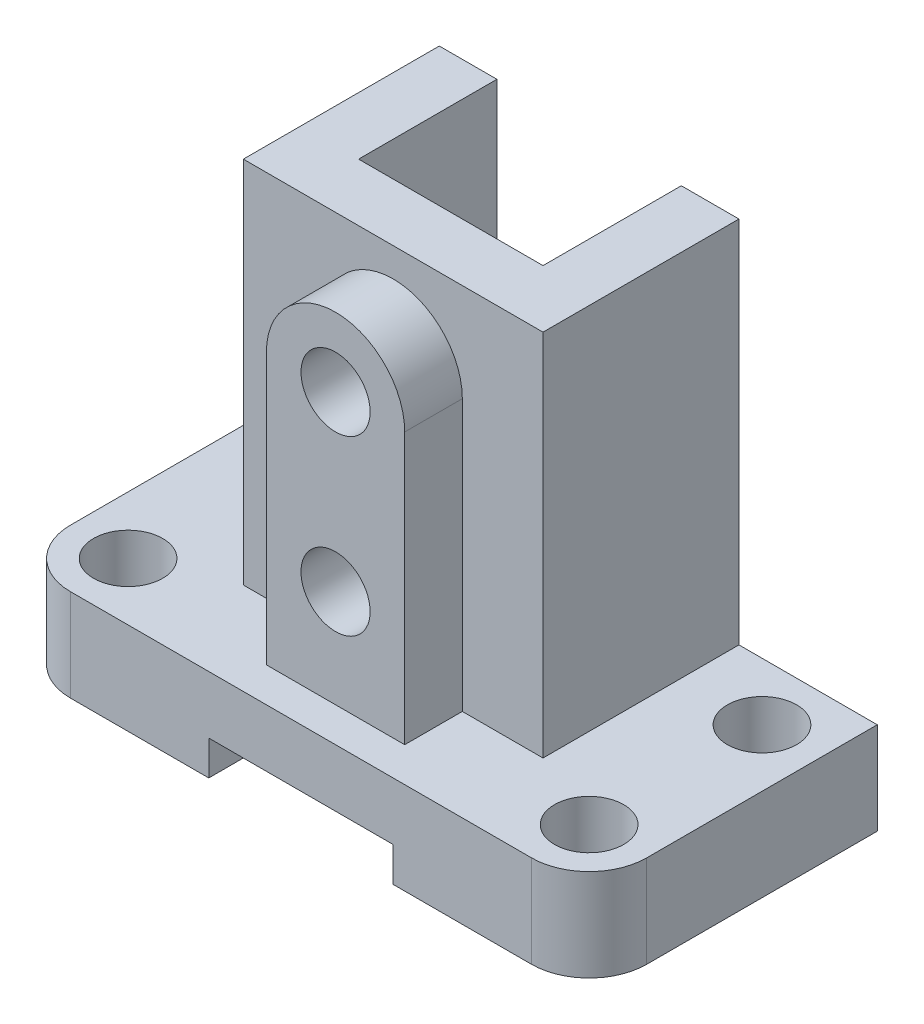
ISO-10303-21;
HEADER;
FILE_DESCRIPTION(('STEP AP214'),'2;1');
FILE_NAME('part.step','',(''),(''),'','','');
FILE_SCHEMA(('AUTOMOTIVE_DESIGN { 1 0 10303 214 1 1 1 1 }'));
ENDSEC;
DATA;
#1=APPLICATION_CONTEXT('core data for automotive mechanical design processes');
#2=APPLICATION_PROTOCOL_DEFINITION('international standard','automotive_design',2000,#1);
#3=PRODUCT_CONTEXT('',#1,'mechanical');
#4=PRODUCT('Part','Part','',(#3));
#5=PRODUCT_RELATED_PRODUCT_CATEGORY('part','',(#4));
#6=PRODUCT_DEFINITION_FORMATION('','',#4);
#7=PRODUCT_DEFINITION_CONTEXT('part definition',#1,'design');
#8=PRODUCT_DEFINITION('design','',#6,#7);
#9=PRODUCT_DEFINITION_SHAPE('','',#8);
#10=(LENGTH_UNIT() NAMED_UNIT(*) SI_UNIT(.MILLI.,.METRE.));
#11=(NAMED_UNIT(*) PLANE_ANGLE_UNIT() SI_UNIT($,.RADIAN.));
#12=(NAMED_UNIT(*) SI_UNIT($,.STERADIAN.) SOLID_ANGLE_UNIT());
#13=UNCERTAINTY_MEASURE_WITH_UNIT(LENGTH_MEASURE(1.E-05),#10,'distance_accuracy_value','');
#14=(GEOMETRIC_REPRESENTATION_CONTEXT(3) GLOBAL_UNCERTAINTY_ASSIGNED_CONTEXT((#13)) GLOBAL_UNIT_ASSIGNED_CONTEXT((#10,
#11,#12)) REPRESENTATION_CONTEXT('',''));
#15=CARTESIAN_POINT('',(0.,0.,0.));
#16=DIRECTION('',(0.,0.,1.));
#17=DIRECTION('',(1.,0.,0.));
#18=AXIS2_PLACEMENT_3D('',#15,#16,#17);
#19=CARTESIAN_POINT('',(-80.,0.,34.5129568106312));
#20=DIRECTION('',(0.,-1.,0.));
#21=DIRECTION('',(0.,0.,-1.));
#22=AXIS2_PLACEMENT_3D('',#19,#20,#21);
#23=PLANE('',#22);
#24=DIRECTION('',(0.,0.,1.));
#25=VECTOR('',#24,1.);
#26=CARTESIAN_POINT('',(-32.,0.,-45.4870431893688));
#27=LINE('',#26,#25);
#28=CARTESIAN_POINT('',(-32.,0.,-45.4870431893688));
#29=VERTEX_POINT('',#28);
#30=CARTESIAN_POINT('',(-32.,0.,54.5129568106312));
#31=VERTEX_POINT('',#30);
#32=EDGE_CURVE('E238',#29,#31,#27,.T.);
#33=ORIENTED_EDGE('',*,*,#32,.T.);
#34=DIRECTION('',(1.,0.,0.));
#35=VECTOR('',#34,1.);
#36=CARTESIAN_POINT('',(-79.9999999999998,0.,54.5129568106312));
#37=LINE('',#36,#35);
#38=CARTESIAN_POINT('',(-79.9999999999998,0.,54.5129568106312));
#39=VERTEX_POINT('',#38);
#40=EDGE_CURVE('E318',#39,#31,#37,.T.);
#41=ORIENTED_EDGE('',*,*,#40,.F.);
#42=CARTESIAN_POINT('',(-80.,0.,34.5129568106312));
#43=DIRECTION('',(0.,1.,0.));
#44=DIRECTION('',(0.,0.,-1.));
#45=AXIS2_PLACEMENT_3D('',#42,#43,#44);
#46=CIRCLE('',#45,20.);
#47=CARTESIAN_POINT('',(-100.,0.,34.5129568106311));
#48=VERTEX_POINT('',#47);
#49=EDGE_CURVE('E314',#48,#39,#46,.T.);
#50=ORIENTED_EDGE('',*,*,#49,.F.);
#51=DIRECTION('',(0.,0.,1.));
#52=VECTOR('',#51,1.);
#53=CARTESIAN_POINT('',(-100.,0.,-45.4870431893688));
#54=LINE('',#53,#52);
#55=CARTESIAN_POINT('',(-100.,0.,-45.4870431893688));
#56=VERTEX_POINT('',#55);
#57=EDGE_CURVE('E310',#56,#48,#54,.T.);
#58=ORIENTED_EDGE('',*,*,#57,.F.);
#59=DIRECTION('',(-1.,0.,0.));
#60=VECTOR('',#59,1.);
#61=CARTESIAN_POINT('',(-100.,0.,-45.4870431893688));
#62=LINE('',#61,#60);
#63=EDGE_CURVE('E324',#29,#56,#62,.T.);
#64=ORIENTED_EDGE('',*,*,#63,.F.);
#65=EDGE_LOOP('',(#33,#41,#50,#58,#64));
#66=FACE_BOUND('',#65,.T.);
#67=CARTESIAN_POINT('',(-80.,0.,34.5129568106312));
#68=DIRECTION('',(0.,-1.,0.));
#69=DIRECTION('',(0.,0.,1.));
#70=AXIS2_PLACEMENT_3D('',#67,#68,#69);
#71=CIRCLE('',#70,12.);
#72=CARTESIAN_POINT('',(-80.,0.,46.5129568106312));
#73=VERTEX_POINT('',#72);
#74=EDGE_CURVE('E400',#73,#73,#71,.T.);
#75=ORIENTED_EDGE('',*,*,#74,.F.);
#76=EDGE_LOOP('',(#75));
#77=FACE_BOUND('',#76,.T.);
#78=CARTESIAN_POINT('',(-80.,0.,-25.4870431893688));
#79=DIRECTION('',(0.,-1.,0.));
#80=DIRECTION('',(0.,0.,1.));
#81=AXIS2_PLACEMENT_3D('',#78,#79,#80);
#82=CIRCLE('',#81,12.);
#83=CARTESIAN_POINT('',(-80.,0.,-13.4870431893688));
#84=VERTEX_POINT('',#83);
#85=EDGE_CURVE('E394',#84,#84,#82,.T.);
#86=ORIENTED_EDGE('',*,*,#85,.F.);
#87=EDGE_LOOP('',(#86));
#88=FACE_BOUND('',#87,.T.);
#89=ADVANCED_FACE('F31',(#66,#77,#88),#23,.T.);
#90=CARTESIAN_POINT('',(-80.,32.,34.5129568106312));
#91=DIRECTION('',(0.,-1.,0.));
#92=DIRECTION('',(0.,0.,-1.));
#93=AXIS2_PLACEMENT_3D('',#90,#91,#92);
#94=PLANE('',#93);
#95=CARTESIAN_POINT('',(-80.,32.,-25.4870431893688));
#96=DIRECTION('',(0.,-1.,0.));
#97=DIRECTION('',(0.,0.,1.));
#98=AXIS2_PLACEMENT_3D('',#95,#96,#97);
#99=CIRCLE('',#98,12.);
#100=CARTESIAN_POINT('',(-80.,32.,-13.4870431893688));
#101=VERTEX_POINT('',#100);
#102=EDGE_CURVE('E397',#101,#101,#99,.T.);
#103=ORIENTED_EDGE('',*,*,#102,.T.);
#104=EDGE_LOOP('',(#103));
#105=FACE_BOUND('',#104,.T.);
#106=CARTESIAN_POINT('',(80.,32.,34.5129568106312));
#107=DIRECTION('',(0.,1.,0.));
#108=DIRECTION('',(0.,0.,1.));
#109=AXIS2_PLACEMENT_3D('',#106,#107,#108);
#110=CIRCLE('',#109,12.);
#111=CARTESIAN_POINT('',(80.,32.,46.5129568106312));
#112=VERTEX_POINT('',#111);
#113=EDGE_CURVE('E391',#112,#112,#110,.T.);
#114=ORIENTED_EDGE('',*,*,#113,.F.);
#115=EDGE_LOOP('',(#114));
#116=FACE_BOUND('',#115,.T.);
#117=CARTESIAN_POINT('',(80.,32.,-25.4870431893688));
#118=DIRECTION('',(0.,1.,0.));
#119=DIRECTION('',(0.,0.,1.));
#120=AXIS2_PLACEMENT_3D('',#117,#118,#119);
#121=CIRCLE('',#120,12.);
#122=CARTESIAN_POINT('',(80.,32.,-13.4870431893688));
#123=VERTEX_POINT('',#122);
#124=EDGE_CURVE('E385',#123,#123,#121,.T.);
#125=ORIENTED_EDGE('',*,*,#124,.F.);
#126=EDGE_LOOP('',(#125));
#127=FACE_BOUND('',#126,.T.);
#128=CARTESIAN_POINT('',(-80.,32.,34.5129568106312));
#129=DIRECTION('',(0.,-1.,0.));
#130=DIRECTION('',(0.,0.,1.));
#131=AXIS2_PLACEMENT_3D('',#128,#129,#130);
#132=CIRCLE('',#131,12.);
#133=CARTESIAN_POINT('',(-80.,32.,46.5129568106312));
#134=VERTEX_POINT('',#133);
#135=EDGE_CURVE('E296',#134,#134,#132,.T.);
#136=ORIENTED_EDGE('',*,*,#135,.T.);
#137=EDGE_LOOP('',(#136));
#138=FACE_BOUND('',#137,.T.);
#139=DIRECTION('',(0.,0.,-1.));
#140=VECTOR('',#139,1.);
#141=CARTESIAN_POINT('',(24.,32.,42.5129568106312));
#142=LINE('',#141,#140);
#143=CARTESIAN_POINT('',(24.,32.,42.5129568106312));
#144=VERTEX_POINT('',#143);
#145=CARTESIAN_POINT('',(24.,32.,22.5129568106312));
#146=VERTEX_POINT('',#145);
#147=EDGE_CURVE('E56',#144,#146,#142,.T.);
#148=ORIENTED_EDGE('',*,*,#147,.F.);
#149=DIRECTION('',(1.,0.,0.));
#150=VECTOR('',#149,1.);
#151=CARTESIAN_POINT('',(24.,32.,42.5129568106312));
#152=LINE('',#151,#150);
#153=CARTESIAN_POINT('',(-24.,32.,42.5129568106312));
#154=VERTEX_POINT('',#153);
#155=EDGE_CURVE('E210',#154,#144,#152,.T.);
#156=ORIENTED_EDGE('',*,*,#155,.F.);
#157=DIRECTION('',(0.,0.,-1.));
#158=VECTOR('',#157,1.);
#159=CARTESIAN_POINT('',(-24.,32.,42.5129568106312));
#160=LINE('',#159,#158);
#161=CARTESIAN_POINT('',(-24.,32.,22.5129568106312));
#162=VERTEX_POINT('',#161);
#163=EDGE_CURVE('E221',#154,#162,#160,.T.);
#164=ORIENTED_EDGE('',*,*,#163,.T.);
#165=DIRECTION('',(1.,0.,0.));
#166=VECTOR('',#165,1.);
#167=CARTESIAN_POINT('',(-52.,32.,22.5129568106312));
#168=LINE('',#167,#166);
#169=CARTESIAN_POINT('',(-52.,32.,22.5129568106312));
#170=VERTEX_POINT('',#169);
#171=EDGE_CURVE('E261',#170,#162,#168,.T.);
#172=ORIENTED_EDGE('',*,*,#171,.F.);
#173=DIRECTION('',(0.,0.,1.));
#174=VECTOR('',#173,1.);
#175=CARTESIAN_POINT('',(-52.,32.,-45.4870431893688));
#176=LINE('',#175,#174);
#177=CARTESIAN_POINT('',(-52.,32.,-45.4870431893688));
#178=VERTEX_POINT('',#177);
#179=EDGE_CURVE('E241',#178,#170,#176,.T.);
#180=ORIENTED_EDGE('',*,*,#179,.F.);
#181=DIRECTION('',(-1.,0.,0.));
#182=VECTOR('',#181,1.);
#183=CARTESIAN_POINT('',(-100.,32.,-45.4870431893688));
#184=LINE('',#183,#182);
#185=CARTESIAN_POINT('',(-100.,32.,-45.4870431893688));
#186=VERTEX_POINT('',#185);
#187=EDGE_CURVE('E301',#178,#186,#184,.T.);
#188=ORIENTED_EDGE('',*,*,#187,.T.);
#189=DIRECTION('',(0.,0.,1.));
#190=VECTOR('',#189,1.);
#191=CARTESIAN_POINT('',(-100.,32.,-45.4870431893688));
#192=LINE('',#191,#190);
#193=CARTESIAN_POINT('',(-100.,32.,34.5129568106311));
#194=VERTEX_POINT('',#193);
#195=EDGE_CURVE('E328',#186,#194,#192,.T.);
#196=ORIENTED_EDGE('',*,*,#195,.T.);
#197=CARTESIAN_POINT('',(-80.,32.,34.5129568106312));
#198=DIRECTION('',(0.,1.,0.));
#199=DIRECTION('',(0.,0.,-1.));
#200=AXIS2_PLACEMENT_3D('',#197,#198,#199);
#201=CIRCLE('',#200,20.);
#202=CARTESIAN_POINT('',(-79.9999999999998,32.,54.5129568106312));
#203=VERTEX_POINT('',#202);
#204=EDGE_CURVE('E379',#194,#203,#201,.T.);
#205=ORIENTED_EDGE('',*,*,#204,.T.);
#206=DIRECTION('',(1.,0.,0.));
#207=VECTOR('',#206,1.);
#208=CARTESIAN_POINT('',(-79.9999999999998,32.,54.5129568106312));
#209=LINE('',#208,#207);
#210=CARTESIAN_POINT('',(79.9999999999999,32.,54.5129568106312));
#211=VERTEX_POINT('',#210);
#212=EDGE_CURVE('E346',#203,#211,#209,.T.);
#213=ORIENTED_EDGE('',*,*,#212,.T.);
#214=CARTESIAN_POINT('',(80.,32.,34.5129568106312));
#215=DIRECTION('',(0.,1.,0.));
#216=DIRECTION('',(0.,0.,1.));
#217=AXIS2_PLACEMENT_3D('',#214,#215,#216);
#218=CIRCLE('',#217,20.);
#219=CARTESIAN_POINT('',(100.,32.,34.5129568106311));
#220=VERTEX_POINT('',#219);
#221=EDGE_CURVE('E377',#211,#220,#218,.T.);
#222=ORIENTED_EDGE('',*,*,#221,.T.);
#223=DIRECTION('',(0.,0.,-1.));
#224=VECTOR('',#223,1.);
#225=CARTESIAN_POINT('',(100.,32.,-45.4870431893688));
#226=LINE('',#225,#224);
#227=CARTESIAN_POINT('',(100.,32.,-45.4870431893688));
#228=VERTEX_POINT('',#227);
#229=EDGE_CURVE('E305',#220,#228,#226,.T.);
#230=ORIENTED_EDGE('',*,*,#229,.T.);
#231=CARTESIAN_POINT('',(52.,32.,-45.4870431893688));
#232=VERTEX_POINT('',#231);
#233=EDGE_CURVE('E304',#228,#232,#184,.T.);
#234=ORIENTED_EDGE('',*,*,#233,.T.);
#235=DIRECTION('',(0.,0.,-1.));
#236=VECTOR('',#235,1.);
#237=CARTESIAN_POINT('',(52.,32.,22.5129568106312));
#238=LINE('',#237,#236);
#239=CARTESIAN_POINT('',(52.,32.,22.5129568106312));
#240=VERTEX_POINT('',#239);
#241=EDGE_CURVE('E246',#240,#232,#238,.T.);
#242=ORIENTED_EDGE('',*,*,#241,.F.);
#243=EDGE_CURVE('E263',#146,#240,#168,.T.);
#244=ORIENTED_EDGE('',*,*,#243,.F.);
#245=EDGE_LOOP('',(#148,#156,#164,#172,#180,#188,#196,#205,#213,#222,#230,#234,#242,#244));
#246=FACE_BOUND('',#245,.T.);
#247=ADVANCED_FACE('F417',(#105,#116,#127,#138,#246),#94,.F.);
#248=CARTESIAN_POINT('',(-52.,160.,22.5129568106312));
#249=DIRECTION('',(0.,0.,-1.));
#250=DIRECTION('',(-1.,0.,0.));
#251=AXIS2_PLACEMENT_3D('',#248,#249,#250);
#252=PLANE('',#251);
#253=DIRECTION('',(0.,1.,0.));
#254=VECTOR('',#253,1.);
#255=CARTESIAN_POINT('',(24.,126.,22.5129568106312));
#256=LINE('',#255,#254);
#257=CARTESIAN_POINT('',(24.,126.,22.5129568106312));
#258=VERTEX_POINT('',#257);
#259=EDGE_CURVE('E209',#146,#258,#256,.T.);
#260=ORIENTED_EDGE('',*,*,#259,.F.);
#261=ORIENTED_EDGE('',*,*,#243,.T.);
#262=DIRECTION('',(0.,-1.,0.));
#263=VECTOR('',#262,1.);
#264=CARTESIAN_POINT('',(52.,160.,22.5129568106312));
#265=LINE('',#264,#263);
#266=CARTESIAN_POINT('',(52.,160.,22.5129568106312));
#267=VERTEX_POINT('',#266);
#268=EDGE_CURVE('E275',#267,#240,#265,.T.);
#269=ORIENTED_EDGE('',*,*,#268,.F.);
#270=DIRECTION('',(1.,0.,0.));
#271=VECTOR('',#270,1.);
#272=CARTESIAN_POINT('',(-52.,160.,22.5129568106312));
#273=LINE('',#272,#271);
#274=CARTESIAN_POINT('',(-52.,160.,22.5129568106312));
#275=VERTEX_POINT('',#274);
#276=EDGE_CURVE('E248',#275,#267,#273,.T.);
#277=ORIENTED_EDGE('',*,*,#276,.F.);
#278=DIRECTION('',(0.,-1.,0.));
#279=VECTOR('',#278,1.);
#280=CARTESIAN_POINT('',(-52.,160.,22.5129568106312));
#281=LINE('',#280,#279);
#282=EDGE_CURVE('E282',#275,#170,#281,.T.);
#283=ORIENTED_EDGE('',*,*,#282,.T.);
#284=ORIENTED_EDGE('',*,*,#171,.T.);
#285=DIRECTION('',(0.,-1.,0.));
#286=VECTOR('',#285,1.);
#287=CARTESIAN_POINT('',(-24.,32.,22.5129568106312));
#288=LINE('',#287,#286);
#289=CARTESIAN_POINT('',(-24.,126.,22.5129568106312));
#290=VERTEX_POINT('',#289);
#291=EDGE_CURVE('E214',#290,#162,#288,.T.);
#292=ORIENTED_EDGE('',*,*,#291,.F.);
#293=CARTESIAN_POINT('',(0.,126.,22.5129568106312));
#294=DIRECTION('',(0.,0.,1.));
#295=DIRECTION('',(-1.,0.,0.));
#296=AXIS2_PLACEMENT_3D('',#293,#294,#295);
#297=CIRCLE('',#296,24.);
#298=EDGE_CURVE('E224',#258,#290,#297,.T.);
#299=ORIENTED_EDGE('',*,*,#298,.F.);
#300=EDGE_LOOP('',(#260,#261,#269,#277,#283,#284,#292,#299));
#301=FACE_BOUND('',#300,.T.);
#302=ADVANCED_FACE('F411',(#301),#252,.F.);
#303=CARTESIAN_POINT('',(-100.,32.,-45.4870431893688));
#304=DIRECTION('',(0.,0.,1.));
#305=DIRECTION('',(1.,0.,0.));
#306=AXIS2_PLACEMENT_3D('',#303,#304,#305);
#307=PLANE('',#306);
#308=DIRECTION('',(0.,-1.,0.));
#309=VECTOR('',#308,1.);
#310=CARTESIAN_POINT('',(-32.,160.,-45.4870431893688));
#311=LINE('',#310,#309);
#312=CARTESIAN_POINT('',(-32.,160.,-45.4870431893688));
#313=VERTEX_POINT('',#312);
#314=EDGE_CURVE('E260',#313,#29,#311,.T.);
#315=ORIENTED_EDGE('',*,*,#314,.T.);
#316=ORIENTED_EDGE('',*,*,#63,.T.);
#317=DIRECTION('',(0.,-1.,0.));
#318=VECTOR('',#317,1.);
#319=CARTESIAN_POINT('',(-100.,32.,-45.4870431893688));
#320=LINE('',#319,#318);
#321=EDGE_CURVE('E329',#186,#56,#320,.T.);
#322=ORIENTED_EDGE('',*,*,#321,.F.);
#323=ORIENTED_EDGE('',*,*,#187,.F.);
#324=DIRECTION('',(0.,-1.,0.));
#325=VECTOR('',#324,1.);
#326=CARTESIAN_POINT('',(-52.,160.,-45.4870431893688));
#327=LINE('',#326,#325);
#328=CARTESIAN_POINT('',(-52.,160.,-45.4870431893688));
#329=VERTEX_POINT('',#328);
#330=EDGE_CURVE('E293',#329,#178,#327,.T.);
#331=ORIENTED_EDGE('',*,*,#330,.F.);
#332=DIRECTION('',(-1.,0.,0.));
#333=VECTOR('',#332,1.);
#334=CARTESIAN_POINT('',(-52.,160.,-45.4870431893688));
#335=LINE('',#334,#333);
#336=EDGE_CURVE('E242',#313,#329,#335,.T.);
#337=ORIENTED_EDGE('',*,*,#336,.F.);
#338=EDGE_LOOP('',(#315,#316,#322,#323,#331,#337));
#339=FACE_BOUND('',#338,.T.);
#340=ADVANCED_FACE('F420',(#339),#307,.F.);
#341=CARTESIAN_POINT('',(32.,0.,54.5129568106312));
#342=VERTEX_POINT('',#341);
#343=CARTESIAN_POINT('',(79.9999999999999,0.,54.5129568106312));
#344=VERTEX_POINT('',#343);
#345=EDGE_CURVE('E317',#342,#344,#37,.T.);
#346=ORIENTED_EDGE('',*,*,#345,.F.);
#347=DIRECTION('',(0.,0.,-1.));
#348=VECTOR('',#347,1.);
#349=CARTESIAN_POINT('',(32.,0.,-45.4870431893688));
#350=LINE('',#349,#348);
#351=CARTESIAN_POINT('',(32.,0.,-45.4870431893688));
#352=VERTEX_POINT('',#351);
#353=EDGE_CURVE('E173',#342,#352,#350,.T.);
#354=ORIENTED_EDGE('',*,*,#353,.T.);
#355=CARTESIAN_POINT('',(100.,0.,-45.4870431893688));
#356=VERTEX_POINT('',#355);
#357=EDGE_CURVE('E325',#356,#352,#62,.T.);
#358=ORIENTED_EDGE('',*,*,#357,.F.);
#359=DIRECTION('',(0.,0.,-1.));
#360=VECTOR('',#359,1.);
#361=CARTESIAN_POINT('',(100.,0.,-45.4870431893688));
#362=LINE('',#361,#360);
#363=CARTESIAN_POINT('',(100.,0.,34.5129568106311));
#364=VERTEX_POINT('',#363);
#365=EDGE_CURVE('E322',#364,#356,#362,.T.);
#366=ORIENTED_EDGE('',*,*,#365,.F.);
#367=CARTESIAN_POINT('',(80.,0.,34.5129568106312));
#368=DIRECTION('',(0.,1.,0.));
#369=DIRECTION('',(0.,0.,1.));
#370=AXIS2_PLACEMENT_3D('',#367,#368,#369);
#371=CIRCLE('',#370,20.);
#372=EDGE_CURVE('E320',#344,#364,#371,.T.);
#373=ORIENTED_EDGE('',*,*,#372,.F.);
#374=EDGE_LOOP('',(#346,#354,#358,#366,#373));
#375=FACE_BOUND('',#374,.T.);
#376=CARTESIAN_POINT('',(80.,0.,34.5129568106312));
#377=DIRECTION('',(0.,1.,0.));
#378=DIRECTION('',(0.,0.,1.));
#379=AXIS2_PLACEMENT_3D('',#376,#377,#378);
#380=CIRCLE('',#379,12.);
#381=CARTESIAN_POINT('',(80.,0.,46.5129568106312));
#382=VERTEX_POINT('',#381);
#383=EDGE_CURVE('E388',#382,#382,#380,.T.);
#384=ORIENTED_EDGE('',*,*,#383,.T.);
#385=EDGE_LOOP('',(#384));
#386=FACE_BOUND('',#385,.T.);
#387=CARTESIAN_POINT('',(80.,0.,-25.4870431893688));
#388=DIRECTION('',(0.,1.,0.));
#389=DIRECTION('',(0.,0.,1.));
#390=AXIS2_PLACEMENT_3D('',#387,#388,#389);
#391=CIRCLE('',#390,12.);
#392=CARTESIAN_POINT('',(80.,0.,-13.4870431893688));
#393=VERTEX_POINT('',#392);
#394=EDGE_CURVE('E315',#393,#393,#391,.T.);
#395=ORIENTED_EDGE('',*,*,#394,.T.);
#396=EDGE_LOOP('',(#395));
#397=FACE_BOUND('',#396,.T.);
#398=ADVANCED_FACE('F370',(#375,#386,#397),#23,.T.);
#399=CARTESIAN_POINT('',(-100.,32.,-45.4870431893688));
#400=DIRECTION('',(1.,0.,0.));
#401=DIRECTION('',(0.,0.,-1.));
#402=AXIS2_PLACEMENT_3D('',#399,#400,#401);
#403=PLANE('',#402);
#404=ORIENTED_EDGE('',*,*,#57,.T.);
#405=DIRECTION('',(0.,-1.,0.));
#406=VECTOR('',#405,1.);
#407=CARTESIAN_POINT('',(-100.,32.,34.5129568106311));
#408=LINE('',#407,#406);
#409=EDGE_CURVE('E11',#194,#48,#408,.T.);
#410=ORIENTED_EDGE('',*,*,#409,.F.);
#411=ORIENTED_EDGE('',*,*,#195,.F.);
#412=ORIENTED_EDGE('',*,*,#321,.T.);
#413=EDGE_LOOP('',(#404,#410,#411,#412));
#414=FACE_BOUND('',#413,.T.);
#415=ADVANCED_FACE('F33',(#414),#403,.F.);
#416=CARTESIAN_POINT('',(-80.,32.,34.5129568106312));
#417=DIRECTION('',(0.,-1.,0.));
#418=DIRECTION('',(0.,0.,-1.));
#419=AXIS2_PLACEMENT_3D('',#416,#417,#418);
#420=CYLINDRICAL_SURFACE('',#419,20.);
#421=ORIENTED_EDGE('',*,*,#49,.T.);
#422=DIRECTION('',(0.,-1.,0.));
#423=VECTOR('',#422,1.);
#424=CARTESIAN_POINT('',(-79.9999999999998,32.,54.5129568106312));
#425=LINE('',#424,#423);
#426=EDGE_CURVE('E40',#203,#39,#425,.T.);
#427=ORIENTED_EDGE('',*,*,#426,.F.);
#428=ORIENTED_EDGE('',*,*,#204,.F.);
#429=ORIENTED_EDGE('',*,*,#409,.T.);
#430=EDGE_LOOP('',(#421,#427,#428,#429));
#431=FACE_BOUND('',#430,.T.);
#432=ADVANCED_FACE('F425',(#431),#420,.T.);
#433=CARTESIAN_POINT('',(-79.9999999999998,32.,54.5129568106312));
#434=DIRECTION('',(0.,0.,-1.));
#435=DIRECTION('',(-1.,0.,0.));
#436=AXIS2_PLACEMENT_3D('',#433,#434,#435);
#437=PLANE('',#436);
#438=ORIENTED_EDGE('',*,*,#40,.T.);
#439=DIRECTION('',(0.,-1.,0.));
#440=VECTOR('',#439,1.);
#441=CARTESIAN_POINT('',(-32.,12.,54.5129568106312));
#442=LINE('',#441,#440);
#443=CARTESIAN_POINT('',(-32.,12.,54.5129568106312));
#444=VERTEX_POINT('',#443);
#445=EDGE_CURVE('E178',#444,#31,#442,.T.);
#446=ORIENTED_EDGE('',*,*,#445,.F.);
#447=DIRECTION('',(-1.,0.,0.));
#448=VECTOR('',#447,1.);
#449=CARTESIAN_POINT('',(-32.,12.,54.5129568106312));
#450=LINE('',#449,#448);
#451=CARTESIAN_POINT('',(32.,12.,54.5129568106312));
#452=VERTEX_POINT('',#451);
#453=EDGE_CURVE('E177',#452,#444,#450,.T.);
#454=ORIENTED_EDGE('',*,*,#453,.F.);
#455=DIRECTION('',(0.,1.,0.));
#456=VECTOR('',#455,1.);
#457=CARTESIAN_POINT('',(32.,12.,54.5129568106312));
#458=LINE('',#457,#456);
#459=EDGE_CURVE('E170',#342,#452,#458,.T.);
#460=ORIENTED_EDGE('',*,*,#459,.F.);
#461=ORIENTED_EDGE('',*,*,#345,.T.);
#462=DIRECTION('',(0.,-1.,0.));
#463=VECTOR('',#462,1.);
#464=CARTESIAN_POINT('',(79.9999999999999,32.,54.5129568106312));
#465=LINE('',#464,#463);
#466=EDGE_CURVE('E338',#211,#344,#465,.T.);
#467=ORIENTED_EDGE('',*,*,#466,.F.);
#468=ORIENTED_EDGE('',*,*,#212,.F.);
#469=ORIENTED_EDGE('',*,*,#426,.T.);
#470=EDGE_LOOP('',(#438,#446,#454,#460,#461,#467,#468,#469));
#471=FACE_BOUND('',#470,.T.);
#472=ADVANCED_FACE('F190',(#471),#437,.F.);
#473=CARTESIAN_POINT('',(80.,32.,34.5129568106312));
#474=DIRECTION('',(0.,-1.,0.));
#475=DIRECTION('',(0.,0.,-1.));
#476=AXIS2_PLACEMENT_3D('',#473,#474,#475);
#477=CYLINDRICAL_SURFACE('',#476,20.);
#478=ORIENTED_EDGE('',*,*,#372,.T.);
#479=DIRECTION('',(0.,-1.,0.));
#480=VECTOR('',#479,1.);
#481=CARTESIAN_POINT('',(100.,32.,34.5129568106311));
#482=LINE('',#481,#480);
#483=EDGE_CURVE('E335',#220,#364,#482,.T.);
#484=ORIENTED_EDGE('',*,*,#483,.F.);
#485=ORIENTED_EDGE('',*,*,#221,.F.);
#486=ORIENTED_EDGE('',*,*,#466,.T.);
#487=EDGE_LOOP('',(#478,#484,#485,#486));
#488=FACE_BOUND('',#487,.T.);
#489=ADVANCED_FACE('F375',(#488),#477,.T.);
#490=CARTESIAN_POINT('',(100.,32.,-45.4870431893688));
#491=DIRECTION('',(-1.,0.,0.));
#492=DIRECTION('',(0.,0.,1.));
#493=AXIS2_PLACEMENT_3D('',#490,#491,#492);
#494=PLANE('',#493);
#495=ORIENTED_EDGE('',*,*,#365,.T.);
#496=DIRECTION('',(0.,-1.,0.));
#497=VECTOR('',#496,1.);
#498=CARTESIAN_POINT('',(100.,32.,-45.4870431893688));
#499=LINE('',#498,#497);
#500=EDGE_CURVE('E332',#228,#356,#499,.T.);
#501=ORIENTED_EDGE('',*,*,#500,.F.);
#502=ORIENTED_EDGE('',*,*,#229,.F.);
#503=ORIENTED_EDGE('',*,*,#483,.T.);
#504=EDGE_LOOP('',(#495,#501,#502,#503));
#505=FACE_BOUND('',#504,.T.);
#506=ADVANCED_FACE('F451',(#505),#494,.F.);
#507=ORIENTED_EDGE('',*,*,#357,.T.);
#508=DIRECTION('',(0.,-1.,0.));
#509=VECTOR('',#508,1.);
#510=CARTESIAN_POINT('',(32.,160.,-45.4870431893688));
#511=LINE('',#510,#509);
#512=CARTESIAN_POINT('',(32.,160.,-45.4870431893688));
#513=VERTEX_POINT('',#512);
#514=EDGE_CURVE('E276',#513,#352,#511,.T.);
#515=ORIENTED_EDGE('',*,*,#514,.F.);
#516=DIRECTION('',(-1.,0.,0.));
#517=VECTOR('',#516,1.);
#518=CARTESIAN_POINT('',(32.,160.,-45.4870431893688));
#519=LINE('',#518,#517);
#520=CARTESIAN_POINT('',(52.,160.,-45.4870431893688));
#521=VERTEX_POINT('',#520);
#522=EDGE_CURVE('E252',#521,#513,#519,.T.);
#523=ORIENTED_EDGE('',*,*,#522,.F.);
#524=DIRECTION('',(0.,-1.,0.));
#525=VECTOR('',#524,1.);
#526=CARTESIAN_POINT('',(52.,160.,-45.4870431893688));
#527=LINE('',#526,#525);
#528=EDGE_CURVE('E273',#521,#232,#527,.T.);
#529=ORIENTED_EDGE('',*,*,#528,.T.);
#530=ORIENTED_EDGE('',*,*,#233,.F.);
#531=ORIENTED_EDGE('',*,*,#500,.T.);
#532=EDGE_LOOP('',(#507,#515,#523,#529,#530,#531));
#533=FACE_BOUND('',#532,.T.);
#534=ADVANCED_FACE('F365',(#533),#307,.F.);
#535=CARTESIAN_POINT('',(80.,0.,-25.4870431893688));
#536=DIRECTION('',(0.,1.,0.));
#537=DIRECTION('',(0.,0.,1.));
#538=AXIS2_PLACEMENT_3D('',#535,#536,#537);
#539=CYLINDRICAL_SURFACE('',#538,12.);
#540=ORIENTED_EDGE('',*,*,#394,.F.);
#541=EDGE_LOOP('',(#540));
#542=FACE_BOUND('',#541,.T.);
#543=ORIENTED_EDGE('',*,*,#124,.T.);
#544=EDGE_LOOP('',(#543));
#545=FACE_BOUND('',#544,.T.);
#546=ADVANCED_FACE('F450',(#542,#545),#539,.F.);
#547=CARTESIAN_POINT('',(80.,0.,34.5129568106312));
#548=DIRECTION('',(0.,1.,0.));
#549=DIRECTION('',(0.,0.,1.));
#550=AXIS2_PLACEMENT_3D('',#547,#548,#549);
#551=CYLINDRICAL_SURFACE('',#550,12.);
#552=ORIENTED_EDGE('',*,*,#383,.F.);
#553=EDGE_LOOP('',(#552));
#554=FACE_BOUND('',#553,.T.);
#555=ORIENTED_EDGE('',*,*,#113,.T.);
#556=EDGE_LOOP('',(#555));
#557=FACE_BOUND('',#556,.T.);
#558=ADVANCED_FACE('F456',(#554,#557),#551,.F.);
#559=CARTESIAN_POINT('',(-80.,0.,-25.4870431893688));
#560=DIRECTION('',(0.,1.,0.));
#561=DIRECTION('',(0.,0.,1.));
#562=AXIS2_PLACEMENT_3D('',#559,#560,#561);
#563=CYLINDRICAL_SURFACE('',#562,12.);
#564=ORIENTED_EDGE('',*,*,#85,.T.);
#565=EDGE_LOOP('',(#564));
#566=FACE_BOUND('',#565,.T.);
#567=ORIENTED_EDGE('',*,*,#102,.F.);
#568=EDGE_LOOP('',(#567));
#569=FACE_BOUND('',#568,.T.);
#570=ADVANCED_FACE('F506',(#566,#569),#563,.F.);
#571=CARTESIAN_POINT('',(-80.,0.,34.5129568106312));
#572=DIRECTION('',(0.,1.,0.));
#573=DIRECTION('',(0.,0.,1.));
#574=AXIS2_PLACEMENT_3D('',#571,#572,#573);
#575=CYLINDRICAL_SURFACE('',#574,12.);
#576=ORIENTED_EDGE('',*,*,#74,.T.);
#577=EDGE_LOOP('',(#576));
#578=FACE_BOUND('',#577,.T.);
#579=ORIENTED_EDGE('',*,*,#135,.F.);
#580=EDGE_LOOP('',(#579));
#581=FACE_BOUND('',#580,.T.);
#582=ADVANCED_FACE('F503',(#578,#581),#575,.F.);
#583=CARTESIAN_POINT('',(-52.,160.,-45.4870431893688));
#584=DIRECTION('',(1.,0.,0.));
#585=DIRECTION('',(0.,0.,-1.));
#586=AXIS2_PLACEMENT_3D('',#583,#584,#585);
#587=PLANE('',#586);
#588=ORIENTED_EDGE('',*,*,#179,.T.);
#589=ORIENTED_EDGE('',*,*,#282,.F.);
#590=DIRECTION('',(0.,0.,1.));
#591=VECTOR('',#590,1.);
#592=CARTESIAN_POINT('',(-52.,160.,-45.4870431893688));
#593=LINE('',#592,#591);
#594=EDGE_CURVE('E245',#329,#275,#593,.T.);
#595=ORIENTED_EDGE('',*,*,#594,.F.);
#596=ORIENTED_EDGE('',*,*,#330,.T.);
#597=EDGE_LOOP('',(#588,#589,#595,#596));
#598=FACE_BOUND('',#597,.T.);
#599=ADVANCED_FACE('F414',(#598),#587,.F.);
#600=CARTESIAN_POINT('',(52.,160.,22.5129568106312));
#601=DIRECTION('',(-1.,0.,0.));
#602=DIRECTION('',(0.,0.,1.));
#603=AXIS2_PLACEMENT_3D('',#600,#601,#602);
#604=PLANE('',#603);
#605=ORIENTED_EDGE('',*,*,#241,.T.);
#606=ORIENTED_EDGE('',*,*,#528,.F.);
#607=DIRECTION('',(0.,0.,-1.));
#608=VECTOR('',#607,1.);
#609=CARTESIAN_POINT('',(52.,160.,22.5129568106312));
#610=LINE('',#609,#608);
#611=EDGE_CURVE('E250',#267,#521,#610,.T.);
#612=ORIENTED_EDGE('',*,*,#611,.F.);
#613=ORIENTED_EDGE('',*,*,#268,.T.);
#614=EDGE_LOOP('',(#605,#606,#612,#613));
#615=FACE_BOUND('',#614,.T.);
#616=ADVANCED_FACE('F466',(#615),#604,.F.);
#617=CARTESIAN_POINT('',(32.,160.,2.51295681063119));
#618=DIRECTION('',(1.,0.,0.));
#619=DIRECTION('',(0.,0.,-1.));
#620=AXIS2_PLACEMENT_3D('',#617,#618,#619);
#621=PLANE('',#620);
#622=ORIENTED_EDGE('',*,*,#514,.T.);
#623=ORIENTED_EDGE('',*,*,#353,.F.);
#624=ORIENTED_EDGE('',*,*,#459,.T.);
#625=DIRECTION('',(0.,0.,1.));
#626=VECTOR('',#625,1.);
#627=CARTESIAN_POINT('',(32.,12.,-45.4870931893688));
#628=LINE('',#627,#626);
#629=CARTESIAN_POINT('',(32.,12.,2.51295681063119));
#630=VERTEX_POINT('',#629);
#631=EDGE_CURVE('E48',#630,#452,#628,.T.);
#632=ORIENTED_EDGE('',*,*,#631,.F.);
#633=DIRECTION('',(0.,-1.,0.));
#634=VECTOR('',#633,1.);
#635=CARTESIAN_POINT('',(32.,160.,2.51295681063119));
#636=LINE('',#635,#634);
#637=CARTESIAN_POINT('',(32.,160.,2.51295681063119));
#638=VERTEX_POINT('',#637);
#639=EDGE_CURVE('E284',#638,#630,#636,.T.);
#640=ORIENTED_EDGE('',*,*,#639,.F.);
#641=DIRECTION('',(0.,0.,1.));
#642=VECTOR('',#641,1.);
#643=CARTESIAN_POINT('',(32.,160.,2.51295681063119));
#644=LINE('',#643,#642);
#645=EDGE_CURVE('E254',#513,#638,#644,.T.);
#646=ORIENTED_EDGE('',*,*,#645,.F.);
#647=EDGE_LOOP('',(#622,#623,#624,#632,#640,#646));
#648=FACE_BOUND('',#647,.T.);
#649=ADVANCED_FACE('F171',(#648),#621,.F.);
#650=CARTESIAN_POINT('',(-32.,160.,2.51295681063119));
#651=DIRECTION('',(0.,0.,1.));
#652=DIRECTION('',(1.,0.,0.));
#653=AXIS2_PLACEMENT_3D('',#650,#651,#652);
#654=PLANE('',#653);
#655=CARTESIAN_POINT('',(0.,66.,2.51295681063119));
#656=DIRECTION('',(0.,0.,1.));
#657=DIRECTION('',(1.,0.,0.));
#658=AXIS2_PLACEMENT_3D('',#655,#656,#657);
#659=CIRCLE('',#658,12.);
#660=CARTESIAN_POINT('',(12.,66.,2.51295681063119));
#661=VERTEX_POINT('',#660);
#662=EDGE_CURVE('E200',#661,#661,#659,.T.);
#663=ORIENTED_EDGE('',*,*,#662,.T.);
#664=EDGE_LOOP('',(#663));
#665=FACE_BOUND('',#664,.T.);
#666=CARTESIAN_POINT('',(0.,126.,2.51295681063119));
#667=DIRECTION('',(0.,0.,1.));
#668=DIRECTION('',(1.,0.,0.));
#669=AXIS2_PLACEMENT_3D('',#666,#667,#668);
#670=CIRCLE('',#669,12.);
#671=CARTESIAN_POINT('',(12.,126.,2.51295681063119));
#672=VERTEX_POINT('',#671);
#673=EDGE_CURVE('E206',#672,#672,#670,.T.);
#674=ORIENTED_EDGE('',*,*,#673,.T.);
#675=EDGE_LOOP('',(#674));
#676=FACE_BOUND('',#675,.T.);
#677=ORIENTED_EDGE('',*,*,#639,.T.);
#678=DIRECTION('',(-1.,0.,0.));
#679=VECTOR('',#678,1.);
#680=CARTESIAN_POINT('',(-32.,12.,2.51295681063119));
#681=LINE('',#680,#679);
#682=CARTESIAN_POINT('',(-32.,12.,2.51295681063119));
#683=VERTEX_POINT('',#682);
#684=EDGE_CURVE('E185',#630,#683,#681,.T.);
#685=ORIENTED_EDGE('',*,*,#684,.T.);
#686=DIRECTION('',(0.,-1.,0.));
#687=VECTOR('',#686,1.);
#688=CARTESIAN_POINT('',(-32.,160.,2.51295681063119));
#689=LINE('',#688,#687);
#690=CARTESIAN_POINT('',(-32.,160.,2.51295681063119));
#691=VERTEX_POINT('',#690);
#692=EDGE_CURVE('E266',#691,#683,#689,.T.);
#693=ORIENTED_EDGE('',*,*,#692,.F.);
#694=DIRECTION('',(-1.,0.,0.));
#695=VECTOR('',#694,1.);
#696=CARTESIAN_POINT('',(-32.,160.,2.51295681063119));
#697=LINE('',#696,#695);
#698=EDGE_CURVE('E256',#638,#691,#697,.T.);
#699=ORIENTED_EDGE('',*,*,#698,.F.);
#700=EDGE_LOOP('',(#677,#685,#693,#699));
#701=FACE_BOUND('',#700,.T.);
#702=ADVANCED_FACE('F360',(#665,#676,#701),#654,.F.);
#703=CARTESIAN_POINT('',(-32.,160.,-45.4870431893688));
#704=DIRECTION('',(-1.,0.,0.));
#705=DIRECTION('',(0.,0.,1.));
#706=AXIS2_PLACEMENT_3D('',#703,#704,#705);
#707=PLANE('',#706);
#708=ORIENTED_EDGE('',*,*,#692,.T.);
#709=DIRECTION('',(0.,0.,1.));
#710=VECTOR('',#709,1.);
#711=CARTESIAN_POINT('',(-32.,12.,-45.4870931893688));
#712=LINE('',#711,#710);
#713=EDGE_CURVE('E187',#683,#444,#712,.T.);
#714=ORIENTED_EDGE('',*,*,#713,.T.);
#715=ORIENTED_EDGE('',*,*,#445,.T.);
#716=ORIENTED_EDGE('',*,*,#32,.F.);
#717=ORIENTED_EDGE('',*,*,#314,.F.);
#718=DIRECTION('',(0.,0.,-1.));
#719=VECTOR('',#718,1.);
#720=CARTESIAN_POINT('',(-32.,160.,-45.4870431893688));
#721=LINE('',#720,#719);
#722=EDGE_CURVE('E258',#691,#313,#721,.T.);
#723=ORIENTED_EDGE('',*,*,#722,.F.);
#724=EDGE_LOOP('',(#708,#714,#715,#716,#717,#723));
#725=FACE_BOUND('',#724,.T.);
#726=ADVANCED_FACE('F356',(#725),#707,.F.);
#727=CARTESIAN_POINT('',(32.,160.,-45.4870431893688));
#728=DIRECTION('',(0.,1.,0.));
#729=DIRECTION('',(0.,0.,1.));
#730=AXIS2_PLACEMENT_3D('',#727,#728,#729);
#731=PLANE('',#730);
#732=ORIENTED_EDGE('',*,*,#336,.T.);
#733=ORIENTED_EDGE('',*,*,#594,.T.);
#734=ORIENTED_EDGE('',*,*,#276,.T.);
#735=ORIENTED_EDGE('',*,*,#611,.T.);
#736=ORIENTED_EDGE('',*,*,#522,.T.);
#737=ORIENTED_EDGE('',*,*,#645,.T.);
#738=ORIENTED_EDGE('',*,*,#698,.T.);
#739=ORIENTED_EDGE('',*,*,#722,.T.);
#740=EDGE_LOOP('',(#732,#733,#734,#735,#736,#737,#738,#739));
#741=FACE_BOUND('',#740,.T.);
#742=ADVANCED_FACE('F363',(#741),#731,.T.);
#743=CARTESIAN_POINT('',(24.,126.,42.5129568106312));
#744=DIRECTION('',(-1.,0.,0.));
#745=DIRECTION('',(0.,-1.,0.));
#746=AXIS2_PLACEMENT_3D('',#743,#744,#745);
#747=PLANE('',#746);
#748=ORIENTED_EDGE('',*,*,#259,.T.);
#749=DIRECTION('',(0.,0.,-1.));
#750=VECTOR('',#749,1.);
#751=CARTESIAN_POINT('',(24.,126.,42.5129568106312));
#752=LINE('',#751,#750);
#753=CARTESIAN_POINT('',(24.,126.,42.5129568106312));
#754=VERTEX_POINT('',#753);
#755=EDGE_CURVE('E234',#754,#258,#752,.T.);
#756=ORIENTED_EDGE('',*,*,#755,.F.);
#757=DIRECTION('',(0.,1.,0.));
#758=VECTOR('',#757,1.);
#759=CARTESIAN_POINT('',(24.,126.,42.5129568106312));
#760=LINE('',#759,#758);
#761=EDGE_CURVE('E213',#144,#754,#760,.T.);
#762=ORIENTED_EDGE('',*,*,#761,.F.);
#763=ORIENTED_EDGE('',*,*,#147,.T.);
#764=EDGE_LOOP('',(#748,#756,#762,#763));
#765=FACE_BOUND('',#764,.T.);
#766=ADVANCED_FACE('F468',(#765),#747,.F.);
#767=CARTESIAN_POINT('',(0.,126.,42.5129568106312));
#768=DIRECTION('',(0.,0.,-1.));
#769=DIRECTION('',(-1.,0.,0.));
#770=AXIS2_PLACEMENT_3D('',#767,#768,#769);
#771=CYLINDRICAL_SURFACE('',#770,24.);
#772=ORIENTED_EDGE('',*,*,#298,.T.);
#773=DIRECTION('',(0.,0.,-1.));
#774=VECTOR('',#773,1.);
#775=CARTESIAN_POINT('',(-24.,126.,42.5129568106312));
#776=LINE('',#775,#774);
#777=CARTESIAN_POINT('',(-24.,126.,42.5129568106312));
#778=VERTEX_POINT('',#777);
#779=EDGE_CURVE('E231',#778,#290,#776,.T.);
#780=ORIENTED_EDGE('',*,*,#779,.F.);
#781=CARTESIAN_POINT('',(0.,126.,42.5129568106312));
#782=DIRECTION('',(0.,0.,1.));
#783=DIRECTION('',(-1.,0.,0.));
#784=AXIS2_PLACEMENT_3D('',#781,#782,#783);
#785=CIRCLE('',#784,24.);
#786=EDGE_CURVE('E216',#754,#778,#785,.T.);
#787=ORIENTED_EDGE('',*,*,#786,.F.);
#788=ORIENTED_EDGE('',*,*,#755,.T.);
#789=EDGE_LOOP('',(#772,#780,#787,#788));
#790=FACE_BOUND('',#789,.T.);
#791=ADVANCED_FACE('F479',(#790),#771,.T.);
#792=CARTESIAN_POINT('',(-24.,32.,42.5129568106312));
#793=DIRECTION('',(1.,0.,0.));
#794=DIRECTION('',(0.,0.,-1.));
#795=AXIS2_PLACEMENT_3D('',#792,#793,#794);
#796=PLANE('',#795);
#797=ORIENTED_EDGE('',*,*,#291,.T.);
#798=ORIENTED_EDGE('',*,*,#163,.F.);
#799=DIRECTION('',(0.,-1.,0.));
#800=VECTOR('',#799,1.);
#801=CARTESIAN_POINT('',(-24.,32.,42.5129568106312));
#802=LINE('',#801,#800);
#803=EDGE_CURVE('E218',#778,#154,#802,.T.);
#804=ORIENTED_EDGE('',*,*,#803,.F.);
#805=ORIENTED_EDGE('',*,*,#779,.T.);
#806=EDGE_LOOP('',(#797,#798,#804,#805));
#807=FACE_BOUND('',#806,.T.);
#808=ADVANCED_FACE('F476',(#807),#796,.F.);
#809=CARTESIAN_POINT('',(0.,126.,42.5129568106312));
#810=DIRECTION('',(0.,0.,-1.));
#811=DIRECTION('',(-1.,0.,0.));
#812=AXIS2_PLACEMENT_3D('',#809,#810,#811);
#813=PLANE('',#812);
#814=CARTESIAN_POINT('',(0.,66.,42.5129568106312));
#815=DIRECTION('',(0.,0.,1.));
#816=DIRECTION('',(1.,0.,0.));
#817=AXIS2_PLACEMENT_3D('',#814,#815,#816);
#818=CIRCLE('',#817,12.);
#819=CARTESIAN_POINT('',(12.,66.,42.5129568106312));
#820=VERTEX_POINT('',#819);
#821=EDGE_CURVE('E197',#820,#820,#818,.T.);
#822=ORIENTED_EDGE('',*,*,#821,.F.);
#823=EDGE_LOOP('',(#822));
#824=FACE_BOUND('',#823,.T.);
#825=CARTESIAN_POINT('',(0.,126.,42.5129568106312));
#826=DIRECTION('',(0.,0.,1.));
#827=DIRECTION('',(1.,0.,0.));
#828=AXIS2_PLACEMENT_3D('',#825,#826,#827);
#829=CIRCLE('',#828,12.);
#830=CARTESIAN_POINT('',(12.,126.,42.5129568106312));
#831=VERTEX_POINT('',#830);
#832=EDGE_CURVE('E203',#831,#831,#829,.T.);
#833=ORIENTED_EDGE('',*,*,#832,.F.);
#834=EDGE_LOOP('',(#833));
#835=FACE_BOUND('',#834,.T.);
#836=ORIENTED_EDGE('',*,*,#155,.T.);
#837=ORIENTED_EDGE('',*,*,#761,.T.);
#838=ORIENTED_EDGE('',*,*,#786,.T.);
#839=ORIENTED_EDGE('',*,*,#803,.T.);
#840=EDGE_LOOP('',(#836,#837,#838,#839));
#841=FACE_BOUND('',#840,.T.);
#842=ADVANCED_FACE('F472',(#824,#835,#841),#813,.F.);
#843=CARTESIAN_POINT('',(0.,126.,-45.4870931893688));
#844=DIRECTION('',(0.,0.,1.));
#845=DIRECTION('',(1.,0.,0.));
#846=AXIS2_PLACEMENT_3D('',#843,#844,#845);
#847=CYLINDRICAL_SURFACE('',#846,12.);
#848=ORIENTED_EDGE('',*,*,#832,.T.);
#849=EDGE_LOOP('',(#848));
#850=FACE_BOUND('',#849,.T.);
#851=ORIENTED_EDGE('',*,*,#673,.F.);
#852=EDGE_LOOP('',(#851));
#853=FACE_BOUND('',#852,.T.);
#854=ADVANCED_FACE('F590',(#850,#853),#847,.F.);
#855=CARTESIAN_POINT('',(0.,66.,-45.4870931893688));
#856=DIRECTION('',(0.,0.,1.));
#857=DIRECTION('',(1.,0.,0.));
#858=AXIS2_PLACEMENT_3D('',#855,#856,#857);
#859=CYLINDRICAL_SURFACE('',#858,12.);
#860=ORIENTED_EDGE('',*,*,#821,.T.);
#861=EDGE_LOOP('',(#860));
#862=FACE_BOUND('',#861,.T.);
#863=ORIENTED_EDGE('',*,*,#662,.F.);
#864=EDGE_LOOP('',(#863));
#865=FACE_BOUND('',#864,.T.);
#866=ADVANCED_FACE('F599',(#862,#865),#859,.F.);
#867=CARTESIAN_POINT('',(-32.,12.,-45.4870931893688));
#868=DIRECTION('',(0.,1.,0.));
#869=DIRECTION('',(-1.,0.,0.));
#870=AXIS2_PLACEMENT_3D('',#867,#868,#869);
#871=PLANE('',#870);
#872=ORIENTED_EDGE('',*,*,#631,.T.);
#873=ORIENTED_EDGE('',*,*,#453,.T.);
#874=ORIENTED_EDGE('',*,*,#713,.F.);
#875=ORIENTED_EDGE('',*,*,#684,.F.);
#876=EDGE_LOOP('',(#872,#873,#874,#875));
#877=FACE_BOUND('',#876,.T.);
#878=ADVANCED_FACE('F182',(#877),#871,.F.);
#879=CLOSED_SHELL('',(#89,#247,#302,#340,#398,#415,#432,#472,#489,#506,#534,#546,#558,#570,#582,
#599,#616,#649,#702,#726,#742,#766,#791,#808,#842,#854,#866,#878));
#880=MANIFOLD_SOLID_BREP('B2',#879);
#881=ADVANCED_BREP_SHAPE_REPRESENTATION('',(#18,#880),#14);
#882=SHAPE_DEFINITION_REPRESENTATION(#9,#881);
ENDSEC;
END-ISO-10303-21;
